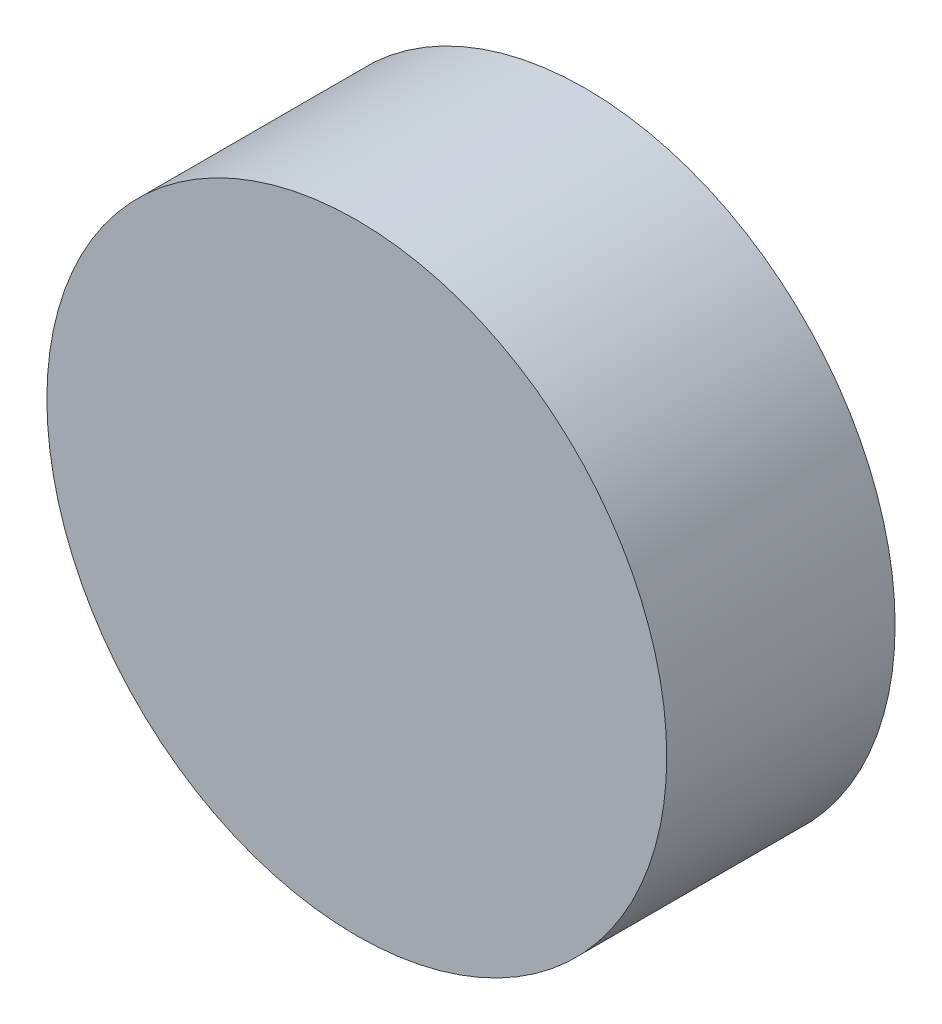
ISO-10303-21;
HEADER;
FILE_DESCRIPTION(('STEP AP214'),'2;1');
FILE_NAME('part.step','',(''),(''),'','','');
FILE_SCHEMA(('AUTOMOTIVE_DESIGN { 1 0 10303 214 1 1 1 1 }'));
ENDSEC;
DATA;
#1=APPLICATION_CONTEXT('core data for automotive mechanical design processes');
#2=APPLICATION_PROTOCOL_DEFINITION('international standard','automotive_design',2000,#1);
#3=PRODUCT_CONTEXT('',#1,'mechanical');
#4=PRODUCT('Part','Part','',(#3));
#5=PRODUCT_RELATED_PRODUCT_CATEGORY('part','',(#4));
#6=PRODUCT_DEFINITION_FORMATION('','',#4);
#7=PRODUCT_DEFINITION_CONTEXT('part definition',#1,'design');
#8=PRODUCT_DEFINITION('design','',#6,#7);
#9=PRODUCT_DEFINITION_SHAPE('','',#8);
#10=(LENGTH_UNIT() NAMED_UNIT(*) SI_UNIT(.MILLI.,.METRE.));
#11=(NAMED_UNIT(*) PLANE_ANGLE_UNIT() SI_UNIT($,.RADIAN.));
#12=(NAMED_UNIT(*) SI_UNIT($,.STERADIAN.) SOLID_ANGLE_UNIT());
#13=UNCERTAINTY_MEASURE_WITH_UNIT(LENGTH_MEASURE(1.E-05),#10,'distance_accuracy_value','');
#14=(GEOMETRIC_REPRESENTATION_CONTEXT(3) GLOBAL_UNCERTAINTY_ASSIGNED_CONTEXT((#13)) GLOBAL_UNIT_ASSIGNED_CONTEXT((#10,
#11,#12)) REPRESENTATION_CONTEXT('',''));
#15=CARTESIAN_POINT('',(0.,0.,0.));
#16=DIRECTION('',(0.,0.,1.));
#17=DIRECTION('',(1.,0.,0.));
#18=AXIS2_PLACEMENT_3D('',#15,#16,#17);
#19=CARTESIAN_POINT('',(0.,0.,0.70000114));
#20=DIRECTION('',(0.,0.,1.));
#21=DIRECTION('',(1.,0.,0.));
#22=AXIS2_PLACEMENT_3D('',#19,#20,#21);
#23=PLANE('',#22);
#24=CARTESIAN_POINT('',(0.,0.,0.70000114));
#25=DIRECTION('',(0.,0.,1.));
#26=DIRECTION('',(1.,0.,0.));
#27=AXIS2_PLACEMENT_3D('',#24,#25,#26);
#28=CIRCLE('',#27,0.95000064);
#29=CARTESIAN_POINT('',(0.95000064,0.,0.70000114));
#30=VERTEX_POINT('',#29);
#31=EDGE_CURVE('E11',#30,#30,#28,.T.);
#32=ORIENTED_EDGE('',*,*,#31,.T.);
#33=EDGE_LOOP('',(#32));
#34=FACE_BOUND('',#33,.T.);
#35=ADVANCED_FACE('F17',(#34),#23,.T.);
#36=CARTESIAN_POINT('',(0.,0.,0.));
#37=DIRECTION('',(0.,0.,1.));
#38=DIRECTION('',(1.,0.,0.));
#39=AXIS2_PLACEMENT_3D('',#36,#37,#38);
#40=PLANE('',#39);
#41=CARTESIAN_POINT('',(0.,0.,0.));
#42=DIRECTION('',(0.,0.,1.));
#43=DIRECTION('',(1.,0.,0.));
#44=AXIS2_PLACEMENT_3D('',#41,#42,#43);
#45=CIRCLE('',#44,0.95000064);
#46=CARTESIAN_POINT('',(0.95000064,0.,0.));
#47=VERTEX_POINT('',#46);
#48=EDGE_CURVE('E42',#47,#47,#45,.T.);
#49=ORIENTED_EDGE('',*,*,#48,.F.);
#50=EDGE_LOOP('',(#49));
#51=FACE_BOUND('',#50,.T.);
#52=ADVANCED_FACE('F64',(#51),#40,.F.);
#53=CARTESIAN_POINT('',(0.,0.,0.));
#54=DIRECTION('',(0.,0.,-1.));
#55=DIRECTION('',(1.,0.,0.));
#56=AXIS2_PLACEMENT_3D('',#53,#54,#55);
#57=CYLINDRICAL_SURFACE('',#56,0.95000064);
#58=ORIENTED_EDGE('',*,*,#48,.T.);
#59=DIRECTION('',(0.,0.,1.));
#60=VECTOR('',#59,1.);
#61=CARTESIAN_POINT('',(0.95000064,0.,0.));
#62=LINE('',#61,#60);
#63=EDGE_CURVE('E25',#47,#30,#62,.T.);
#64=ORIENTED_EDGE('',*,*,#63,.T.);
#65=ORIENTED_EDGE('',*,*,#31,.F.);
#66=ORIENTED_EDGE('',*,*,#63,.F.);
#67=EDGE_LOOP('',(#58,#64,#65,#66));
#68=FACE_BOUND('',#67,.T.);
#69=ADVANCED_FACE('F40',(#68),#57,.T.);
#70=CLOSED_SHELL('',(#35,#52,#69));
#71=MANIFOLD_SOLID_BREP('B1',#70);
#72=ADVANCED_BREP_SHAPE_REPRESENTATION('',(#18,#71),#14);
#73=SHAPE_DEFINITION_REPRESENTATION(#9,#72);
ENDSEC;
END-ISO-10303-21;
